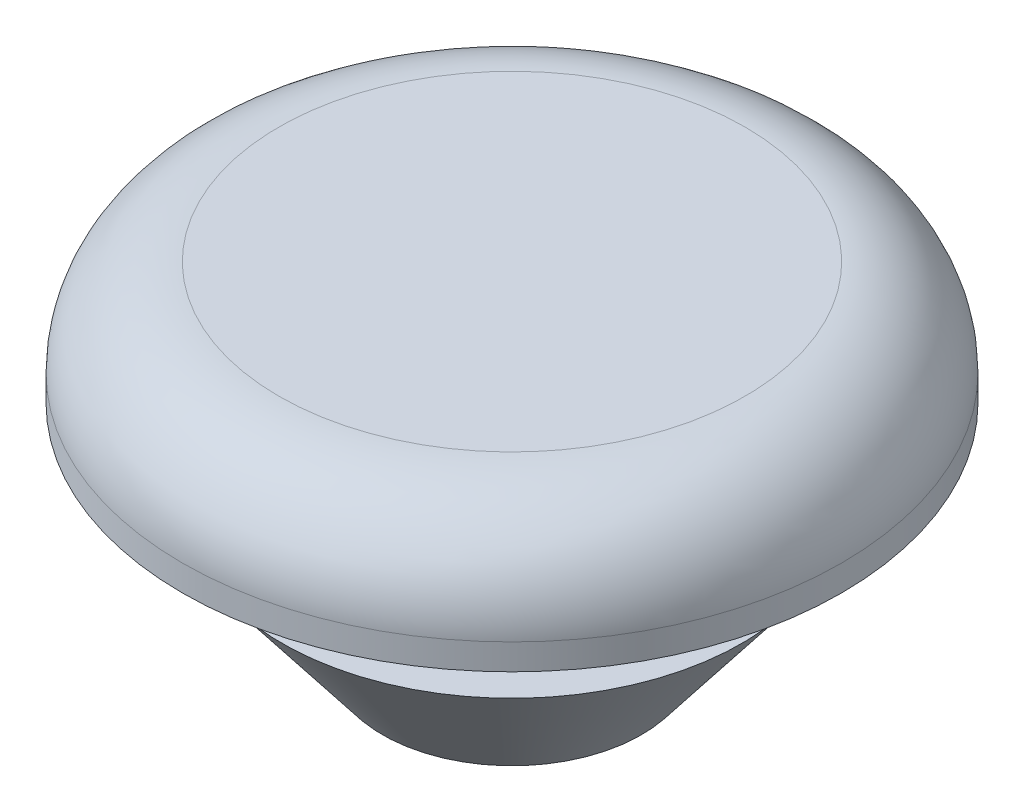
from build123d import *


with BuildPart() as part:
    # Sketch1 → Revolve1 (revolve)
    with BuildSketch(Plane(origin=(0, 0, 0), x_dir=(0, 0, -1), z_dir=(1, 0, 0))):
        with BuildLine():
            Line((0, 0), (3.175, 0))
            Line((3.175, 0), (5.6388, 3.175))
            Line((5.6388, 3.175), (3.7592, 3.175))
            Line((3.7592, 3.175), (3.7592, 5.461))
            Line((3.7592, 5.461), (8.0772, 5.461))
            Line((8.0772, 5.461), (8.0772, 6.096))
            ThreePointArc((8.0772, 6.096), (7.385327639, 7.766327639), (5.715, 8.4582))
            Line((5.715, 8.4582), (0, 8.4582))
            Line((0, 8.4582), (0, 0))
        make_face()
    revolve(axis=Axis((0, 0, 0), (0, 1, 0)))


solid = part.part
